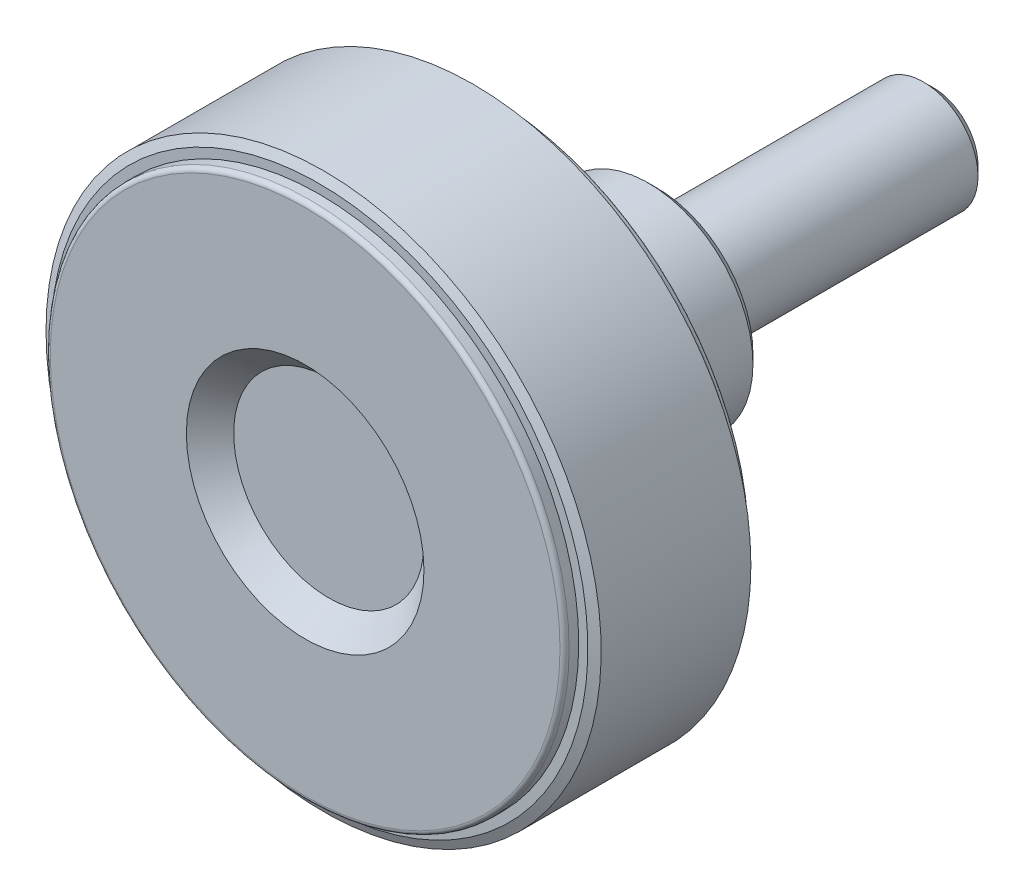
ISO-10303-21;
HEADER;
FILE_DESCRIPTION(('STEP AP214'),'2;1');
FILE_NAME('part.step','',(''),(''),'','','');
FILE_SCHEMA(('AUTOMOTIVE_DESIGN { 1 0 10303 214 1 1 1 1 }'));
ENDSEC;
DATA;
#1=APPLICATION_CONTEXT('core data for automotive mechanical design processes');
#2=APPLICATION_PROTOCOL_DEFINITION('international standard','automotive_design',2000,#1);
#3=PRODUCT_CONTEXT('',#1,'mechanical');
#4=PRODUCT('Part','Part','',(#3));
#5=PRODUCT_RELATED_PRODUCT_CATEGORY('part','',(#4));
#6=PRODUCT_DEFINITION_FORMATION('','',#4);
#7=PRODUCT_DEFINITION_CONTEXT('part definition',#1,'design');
#8=PRODUCT_DEFINITION('design','',#6,#7);
#9=PRODUCT_DEFINITION_SHAPE('','',#8);
#10=(LENGTH_UNIT() NAMED_UNIT(*) SI_UNIT(.MILLI.,.METRE.));
#11=(NAMED_UNIT(*) PLANE_ANGLE_UNIT() SI_UNIT($,.RADIAN.));
#12=(NAMED_UNIT(*) SI_UNIT($,.STERADIAN.) SOLID_ANGLE_UNIT());
#13=UNCERTAINTY_MEASURE_WITH_UNIT(LENGTH_MEASURE(1.E-05),#10,'distance_accuracy_value','');
#14=(GEOMETRIC_REPRESENTATION_CONTEXT(3) GLOBAL_UNCERTAINTY_ASSIGNED_CONTEXT((#13)) GLOBAL_UNIT_ASSIGNED_CONTEXT((#10,
#11,#12)) REPRESENTATION_CONTEXT('',''));
#15=CARTESIAN_POINT('',(0.,0.,0.));
#16=DIRECTION('',(0.,0.,1.));
#17=DIRECTION('',(1.,0.,0.));
#18=AXIS2_PLACEMENT_3D('',#15,#16,#17);
#19=CARTESIAN_POINT('',(0.,2.46325,-30.));
#20=DIRECTION('',(0.,0.,-1.));
#21=DIRECTION('',(-1.,0.,0.));
#22=AXIS2_PLACEMENT_3D('',#19,#20,#21);
#23=PLANE('',#22);
#24=CARTESIAN_POINT('',(0.,0.,-29.9999999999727));
#25=DIRECTION('',(0.,0.,1.));
#26=DIRECTION('',(1.,0.,0.));
#27=AXIS2_PLACEMENT_3D('',#24,#25,#26);
#28=CIRCLE('',#27,4.92650000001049);
#29=CARTESIAN_POINT('',(4.92650000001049,0.,-29.9999999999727));
#30=VERTEX_POINT('',#29);
#31=EDGE_CURVE('E179',#30,#30,#28,.T.);
#32=ORIENTED_EDGE('',*,*,#31,.F.);
#33=EDGE_LOOP('',(#32));
#34=FACE_BOUND('',#33,.T.);
#35=ADVANCED_FACE('F14',(#34),#23,.T.);
#36=CARTESIAN_POINT('',(0.,0.,-28.9265000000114));
#37=DIRECTION('',(0.,0.,1.));
#38=DIRECTION('',(1.,0.,0.));
#39=AXIS2_PLACEMENT_3D('',#36,#37,#38);
#40=CONICAL_SURFACE('',#39,5.99999999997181,0.785398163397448);
#41=ORIENTED_EDGE('',*,*,#31,.T.);
#42=EDGE_LOOP('',(#41));
#43=FACE_BOUND('',#42,.T.);
#44=CARTESIAN_POINT('',(0.,0.,-28.9265));
#45=DIRECTION('',(0.,0.,1.));
#46=DIRECTION('',(1.,0.,0.));
#47=AXIS2_PLACEMENT_3D('',#44,#45,#46);
#48=CIRCLE('',#47,6.);
#49=CARTESIAN_POINT('',(6.,0.,-28.9265));
#50=VERTEX_POINT('',#49);
#51=EDGE_CURVE('E176',#50,#50,#48,.T.);
#52=ORIENTED_EDGE('',*,*,#51,.F.);
#53=EDGE_LOOP('',(#52));
#54=FACE_BOUND('',#53,.T.);
#55=ADVANCED_FACE('F536',(#43,#54),#40,.T.);
#56=CARTESIAN_POINT('',(0.,0.,-13.96325));
#57=DIRECTION('',(0.,0.,1.));
#58=DIRECTION('',(1.,0.,0.));
#59=AXIS2_PLACEMENT_3D('',#56,#57,#58);
#60=CYLINDRICAL_SURFACE('',#59,6.);
#61=ORIENTED_EDGE('',*,*,#51,.T.);
#62=EDGE_LOOP('',(#61));
#63=FACE_BOUND('',#62,.T.);
#64=CARTESIAN_POINT('',(0.,0.,0.));
#65=DIRECTION('',(0.,0.,1.));
#66=DIRECTION('',(1.,0.,0.));
#67=AXIS2_PLACEMENT_3D('',#64,#65,#66);
#68=CIRCLE('',#67,6.);
#69=CARTESIAN_POINT('',(6.,0.,0.));
#70=VERTEX_POINT('',#69);
#71=EDGE_CURVE('E178',#70,#70,#68,.T.);
#72=ORIENTED_EDGE('',*,*,#71,.F.);
#73=EDGE_LOOP('',(#72));
#74=FACE_BOUND('',#73,.T.);
#75=ADVANCED_FACE('F526',(#63,#74),#60,.T.);
#76=CARTESIAN_POINT('',(0.,4.,0.));
#77=DIRECTION('',(0.,0.,-1.));
#78=DIRECTION('',(-1.,0.,0.));
#79=AXIS2_PLACEMENT_3D('',#76,#77,#78);
#80=PLANE('',#79);
#81=CARTESIAN_POINT('',(0.,0.,0.));
#82=DIRECTION('',(0.,0.,1.));
#83=DIRECTION('',(1.,0.,0.));
#84=AXIS2_PLACEMENT_3D('',#81,#82,#83);
#85=CIRCLE('',#84,8.);
#86=CARTESIAN_POINT('',(8.,0.,0.));
#87=VERTEX_POINT('',#86);
#88=EDGE_CURVE('E211',#87,#87,#85,.T.);
#89=ORIENTED_EDGE('',*,*,#88,.F.);
#90=EDGE_LOOP('',(#89));
#91=FACE_BOUND('',#90,.T.);
#92=ORIENTED_EDGE('',*,*,#71,.T.);
#93=EDGE_LOOP('',(#92));
#94=FACE_BOUND('',#93,.T.);
#95=ADVANCED_FACE('F516',(#91,#94),#80,.T.);
#96=CARTESIAN_POINT('',(0.,0.,0.15));
#97=DIRECTION('',(0.,0.,1.));
#98=DIRECTION('',(1.,0.,0.));
#99=AXIS2_PLACEMENT_3D('',#96,#97,#98);
#100=CYLINDRICAL_SURFACE('',#99,8.);
#101=ORIENTED_EDGE('',*,*,#88,.T.);
#102=EDGE_LOOP('',(#101));
#103=FACE_BOUND('',#102,.T.);
#104=CARTESIAN_POINT('',(0.,0.,0.3));
#105=DIRECTION('',(0.,0.,1.));
#106=DIRECTION('',(1.,0.,0.));
#107=AXIS2_PLACEMENT_3D('',#104,#105,#106);
#108=CIRCLE('',#107,8.);
#109=CARTESIAN_POINT('',(8.,0.,0.3));
#110=VERTEX_POINT('',#109);
#111=EDGE_CURVE('E208',#110,#110,#108,.T.);
#112=ORIENTED_EDGE('',*,*,#111,.F.);
#113=EDGE_LOOP('',(#112));
#114=FACE_BOUND('',#113,.T.);
#115=ADVANCED_FACE('F506',(#103,#114),#100,.T.);
#116=CARTESIAN_POINT('',(0.,9.25,0.3));
#117=DIRECTION('',(0.,0.,-1.));
#118=DIRECTION('',(-1.,0.,0.));
#119=AXIS2_PLACEMENT_3D('',#116,#117,#118);
#120=PLANE('',#119);
#121=CARTESIAN_POINT('',(0.,0.,0.3));
#122=DIRECTION('',(0.,0.,1.));
#123=DIRECTION('',(1.,0.,0.));
#124=AXIS2_PLACEMENT_3D('',#121,#122,#123);
#125=CIRCLE('',#124,10.5);
#126=CARTESIAN_POINT('',(10.5,0.,0.3));
#127=VERTEX_POINT('',#126);
#128=EDGE_CURVE('E175',#127,#127,#125,.T.);
#129=ORIENTED_EDGE('',*,*,#128,.F.);
#130=EDGE_LOOP('',(#129));
#131=FACE_BOUND('',#130,.T.);
#132=ORIENTED_EDGE('',*,*,#111,.T.);
#133=EDGE_LOOP('',(#132));
#134=FACE_BOUND('',#133,.T.);
#135=ADVANCED_FACE('F496',(#131,#134),#120,.T.);
#136=CARTESIAN_POINT('',(0.,0.,1.3));
#137=DIRECTION('',(0.,0.,1.));
#138=DIRECTION('',(1.,0.,0.));
#139=AXIS2_PLACEMENT_3D('',#136,#137,#138);
#140=CONICAL_SURFACE('',#139,11.5,0.785398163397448);
#141=ORIENTED_EDGE('',*,*,#128,.T.);
#142=EDGE_LOOP('',(#141));
#143=FACE_BOUND('',#142,.T.);
#144=CARTESIAN_POINT('',(0.,0.,1.3));
#145=DIRECTION('',(0.,0.,1.));
#146=DIRECTION('',(1.,0.,0.));
#147=AXIS2_PLACEMENT_3D('',#144,#145,#146);
#148=CIRCLE('',#147,11.5);
#149=CARTESIAN_POINT('',(11.5,0.,1.3));
#150=VERTEX_POINT('',#149);
#151=EDGE_CURVE('E172',#150,#150,#148,.T.);
#152=ORIENTED_EDGE('',*,*,#151,.F.);
#153=EDGE_LOOP('',(#152));
#154=FACE_BOUND('',#153,.T.);
#155=ADVANCED_FACE('F487',(#143,#154),#140,.T.);
#156=CARTESIAN_POINT('',(0.,0.,16.4));
#157=DIRECTION('',(0.,0.,1.));
#158=DIRECTION('',(1.,0.,0.));
#159=AXIS2_PLACEMENT_3D('',#156,#157,#158);
#160=CYLINDRICAL_SURFACE('',#159,11.5);
#161=ORIENTED_EDGE('',*,*,#151,.T.);
#162=EDGE_LOOP('',(#161));
#163=FACE_BOUND('',#162,.T.);
#164=CARTESIAN_POINT('',(0.,0.,31.5));
#165=DIRECTION('',(0.,0.,-1.));
#166=DIRECTION('',(-1.,0.,0.));
#167=AXIS2_PLACEMENT_3D('',#164,#165,#166);
#168=CIRCLE('',#167,11.5);
#169=CARTESIAN_POINT('',(-11.5,0.,31.5));
#170=VERTEX_POINT('',#169);
#171=EDGE_CURVE('E75',#170,#170,#168,.T.);
#172=ORIENTED_EDGE('',*,*,#171,.T.);
#173=EDGE_LOOP('',(#172));
#174=FACE_BOUND('',#173,.T.);
#175=ADVANCED_FACE('F482',(#163,#174),#160,.T.);
#176=CARTESIAN_POINT('',(0.,0.,31.5));
#177=DIRECTION('',(0.,0.,-1.));
#178=DIRECTION('',(-1.,0.,0.));
#179=AXIS2_PLACEMENT_3D('',#176,#177,#178);
#180=TOROIDAL_SURFACE('',#179,12.5,1.);
#181=CARTESIAN_POINT('',(0.,0.,32.5));
#182=DIRECTION('',(0.,0.,-1.));
#183=DIRECTION('',(1.,0.,0.));
#184=AXIS2_PLACEMENT_3D('',#181,#182,#183);
#185=CIRCLE('',#184,12.5);
#186=CARTESIAN_POINT('',(-12.5,0.,32.5));
#187=VERTEX_POINT('',#186);
#188=CARTESIAN_POINT('',(12.5,0.,32.5));
#189=VERTEX_POINT('',#188);
#190=EDGE_CURVE('E68',#187,#189,#185,.F.);
#191=ORIENTED_EDGE('',*,*,#190,.F.);
#192=CARTESIAN_POINT('',(0.,0.,32.5));
#193=DIRECTION('',(0.,0.,-1.));
#194=DIRECTION('',(-1.,0.,0.));
#195=AXIS2_PLACEMENT_3D('',#192,#193,#194);
#196=CIRCLE('',#195,12.5);
#197=CARTESIAN_POINT('',(0.,12.5,32.5));
#198=VERTEX_POINT('',#197);
#199=EDGE_CURVE('E71',#198,#187,#196,.F.);
#200=ORIENTED_EDGE('',*,*,#199,.F.);
#201=CARTESIAN_POINT('',(0.,0.,32.5));
#202=DIRECTION('',(0.,0.,-1.));
#203=DIRECTION('',(0.,1.,0.));
#204=AXIS2_PLACEMENT_3D('',#201,#202,#203);
#205=CIRCLE('',#204,12.5);
#206=EDGE_CURVE('E63',#189,#198,#205,.F.);
#207=ORIENTED_EDGE('',*,*,#206,.F.);
#208=EDGE_LOOP('',(#191,#200,#207));
#209=FACE_BOUND('',#208,.T.);
#210=ORIENTED_EDGE('',*,*,#171,.F.);
#211=EDGE_LOOP('',(#210));
#212=FACE_BOUND('',#211,.T.);
#213=ADVANCED_FACE('F66',(#209,#212),#180,.F.);
#214=CARTESIAN_POINT('',(0.,17.4807692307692,32.5));
#215=DIRECTION('',(0.,0.,-1.));
#216=DIRECTION('',(-1.,0.,0.));
#217=AXIS2_PLACEMENT_3D('',#214,#215,#216);
#218=PLANE('',#217);
#219=CARTESIAN_POINT('',(0.,0.,32.5));
#220=DIRECTION('',(0.,0.,1.));
#221=DIRECTION('',(-1.,0.,0.));
#222=AXIS2_PLACEMENT_3D('',#219,#220,#221);
#223=CIRCLE('',#222,22.4615384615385);
#224=CARTESIAN_POINT('',(22.4615384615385,0.,32.5));
#225=VERTEX_POINT('',#224);
#226=CARTESIAN_POINT('',(-22.4615384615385,0.,32.5));
#227=VERTEX_POINT('',#226);
#228=EDGE_CURVE('E81',#225,#227,#223,.F.);
#229=ORIENTED_EDGE('',*,*,#228,.T.);
#230=CARTESIAN_POINT('',(0.,0.,32.5));
#231=DIRECTION('',(0.,0.,1.));
#232=DIRECTION('',(0.,1.,0.));
#233=AXIS2_PLACEMENT_3D('',#230,#231,#232);
#234=CIRCLE('',#233,22.4615384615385);
#235=CARTESIAN_POINT('',(0.,22.4615384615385,32.5));
#236=VERTEX_POINT('',#235);
#237=EDGE_CURVE('E130',#227,#236,#234,.F.);
#238=ORIENTED_EDGE('',*,*,#237,.T.);
#239=CARTESIAN_POINT('',(0.,0.,32.5));
#240=DIRECTION('',(0.,0.,1.));
#241=DIRECTION('',(1.,0.,0.));
#242=AXIS2_PLACEMENT_3D('',#239,#240,#241);
#243=CIRCLE('',#242,22.4615384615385);
#244=EDGE_CURVE('E143',#236,#225,#243,.F.);
#245=ORIENTED_EDGE('',*,*,#244,.T.);
#246=EDGE_LOOP('',(#229,#238,#245));
#247=FACE_BOUND('',#246,.T.);
#248=ORIENTED_EDGE('',*,*,#199,.T.);
#249=ORIENTED_EDGE('',*,*,#190,.T.);
#250=ORIENTED_EDGE('',*,*,#206,.T.);
#251=EDGE_LOOP('',(#248,#249,#250));
#252=FACE_BOUND('',#251,.T.);
#253=ADVANCED_FACE('F79',(#247,#252),#218,.T.);
#254=CARTESIAN_POINT('',(0.,0.,31.5));
#255=DIRECTION('',(0.,0.,-1.));
#256=DIRECTION('',(-1.,0.,0.));
#257=AXIS2_PLACEMENT_3D('',#254,#255,#256);
#258=TOROIDAL_SURFACE('',#257,22.4615384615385,1.);
#259=ORIENTED_EDGE('',*,*,#237,.F.);
#260=ORIENTED_EDGE('',*,*,#228,.F.);
#261=ORIENTED_EDGE('',*,*,#244,.F.);
#262=EDGE_LOOP('',(#259,#260,#261));
#263=FACE_BOUND('',#262,.T.);
#264=CARTESIAN_POINT('',(0.,0.,31.5));
#265=DIRECTION('',(0.,0.,1.));
#266=DIRECTION('',(1.,0.,0.));
#267=AXIS2_PLACEMENT_3D('',#264,#265,#266);
#268=CIRCLE('',#267,23.4615384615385);
#269=CARTESIAN_POINT('',(23.4615384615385,0.,31.5));
#270=VERTEX_POINT('',#269);
#271=EDGE_CURVE('E205',#270,#270,#268,.F.);
#272=ORIENTED_EDGE('',*,*,#271,.T.);
#273=EDGE_LOOP('',(#272));
#274=FACE_BOUND('',#273,.T.);
#275=ADVANCED_FACE('F100',(#263,#274),#258,.F.);
#276=CARTESIAN_POINT('',(0.,0.,25.));
#277=DIRECTION('',(0.,0.,1.));
#278=DIRECTION('',(1.,0.,0.));
#279=AXIS2_PLACEMENT_3D('',#276,#277,#278);
#280=CYLINDRICAL_SURFACE('',#279,23.4615384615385);
#281=ORIENTED_EDGE('',*,*,#271,.F.);
#282=EDGE_LOOP('',(#281));
#283=FACE_BOUND('',#282,.T.);
#284=CARTESIAN_POINT('',(0.,0.,18.5));
#285=DIRECTION('',(0.,0.,1.));
#286=DIRECTION('',(1.,0.,0.));
#287=AXIS2_PLACEMENT_3D('',#284,#285,#286);
#288=CIRCLE('',#287,23.4615384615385);
#289=CARTESIAN_POINT('',(23.4615384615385,0.,18.5));
#290=VERTEX_POINT('',#289);
#291=EDGE_CURVE('E201',#290,#290,#288,.T.);
#292=ORIENTED_EDGE('',*,*,#291,.F.);
#293=EDGE_LOOP('',(#292));
#294=FACE_BOUND('',#293,.T.);
#295=ADVANCED_FACE('F329',(#283,#294),#280,.F.);
#296=CARTESIAN_POINT('',(0.,25.7307692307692,18.5));
#297=DIRECTION('',(0.,0.,-1.));
#298=DIRECTION('',(-1.,0.,0.));
#299=AXIS2_PLACEMENT_3D('',#296,#297,#298);
#300=PLANE('',#299);
#301=CARTESIAN_POINT('',(0.,0.,18.5));
#302=DIRECTION('',(0.,0.,1.));
#303=DIRECTION('',(-1.,0.,0.));
#304=AXIS2_PLACEMENT_3D('',#301,#302,#303);
#305=CIRCLE('',#304,28.);
#306=CARTESIAN_POINT('',(-28.,0.,18.5));
#307=VERTEX_POINT('',#306);
#308=CARTESIAN_POINT('',(28.,0.,18.5));
#309=VERTEX_POINT('',#308);
#310=EDGE_CURVE('E264',#307,#309,#305,.T.);
#311=ORIENTED_EDGE('',*,*,#310,.F.);
#312=CARTESIAN_POINT('',(0.,0.,18.5));
#313=DIRECTION('',(0.,0.,1.));
#314=DIRECTION('',(0.,1.,0.));
#315=AXIS2_PLACEMENT_3D('',#312,#313,#314);
#316=CIRCLE('',#315,28.);
#317=CARTESIAN_POINT('',(0.,28.,18.5));
#318=VERTEX_POINT('',#317);
#319=EDGE_CURVE('E299',#318,#307,#316,.T.);
#320=ORIENTED_EDGE('',*,*,#319,.F.);
#321=CARTESIAN_POINT('',(0.,0.,18.5));
#322=DIRECTION('',(0.,0.,1.));
#323=DIRECTION('',(1.,0.,0.));
#324=AXIS2_PLACEMENT_3D('',#321,#322,#323);
#325=CIRCLE('',#324,28.);
#326=EDGE_CURVE('E204',#309,#318,#325,.T.);
#327=ORIENTED_EDGE('',*,*,#326,.F.);
#328=EDGE_LOOP('',(#311,#320,#327));
#329=FACE_BOUND('',#328,.T.);
#330=ORIENTED_EDGE('',*,*,#291,.T.);
#331=EDGE_LOOP('',(#330));
#332=FACE_BOUND('',#331,.T.);
#333=ADVANCED_FACE('F275',(#329,#332),#300,.T.);
#334=CARTESIAN_POINT('',(0.,0.,19.));
#335=DIRECTION('',(0.,0.,-1.));
#336=DIRECTION('',(-1.,0.,0.));
#337=AXIS2_PLACEMENT_3D('',#334,#335,#336);
#338=TOROIDAL_SURFACE('',#337,28.,0.5);
#339=ORIENTED_EDGE('',*,*,#319,.T.);
#340=ORIENTED_EDGE('',*,*,#310,.T.);
#341=ORIENTED_EDGE('',*,*,#326,.T.);
#342=EDGE_LOOP('',(#339,#340,#341));
#343=FACE_BOUND('',#342,.T.);
#344=CARTESIAN_POINT('',(0.,0.,19.));
#345=DIRECTION('',(0.,0.,1.));
#346=DIRECTION('',(1.,0.,0.));
#347=AXIS2_PLACEMENT_3D('',#344,#345,#346);
#348=CIRCLE('',#347,28.5);
#349=CARTESIAN_POINT('',(28.5,0.,19.));
#350=VERTEX_POINT('',#349);
#351=EDGE_CURVE('E200',#350,#350,#348,.T.);
#352=ORIENTED_EDGE('',*,*,#351,.F.);
#353=EDGE_LOOP('',(#352));
#354=FACE_BOUND('',#353,.T.);
#355=ADVANCED_FACE('F269',(#343,#354),#338,.T.);
#356=CARTESIAN_POINT('',(0.,0.,19.53));
#357=DIRECTION('',(0.,0.,1.));
#358=DIRECTION('',(1.,0.,0.));
#359=AXIS2_PLACEMENT_3D('',#356,#357,#358);
#360=CYLINDRICAL_SURFACE('',#359,28.5);
#361=ORIENTED_EDGE('',*,*,#351,.T.);
#362=EDGE_LOOP('',(#361));
#363=FACE_BOUND('',#362,.T.);
#364=CARTESIAN_POINT('',(0.,0.,20.06));
#365=DIRECTION('',(0.,0.,1.));
#366=DIRECTION('',(1.,0.,0.));
#367=AXIS2_PLACEMENT_3D('',#364,#365,#366);
#368=CIRCLE('',#367,28.5);
#369=CARTESIAN_POINT('',(28.5,0.,20.06));
#370=VERTEX_POINT('',#369);
#371=EDGE_CURVE('E197',#370,#370,#368,.T.);
#372=ORIENTED_EDGE('',*,*,#371,.F.);
#373=EDGE_LOOP('',(#372));
#374=FACE_BOUND('',#373,.T.);
#375=ADVANCED_FACE('F274',(#363,#374),#360,.T.);
#376=CARTESIAN_POINT('',(0.,29.,20.06));
#377=DIRECTION('',(0.,0.,-1.));
#378=DIRECTION('',(-1.,0.,0.));
#379=AXIS2_PLACEMENT_3D('',#376,#377,#378);
#380=PLANE('',#379);
#381=CARTESIAN_POINT('',(0.,0.,20.06));
#382=DIRECTION('',(0.,0.,1.));
#383=DIRECTION('',(1.,0.,0.));
#384=AXIS2_PLACEMENT_3D('',#381,#382,#383);
#385=CIRCLE('',#384,29.5);
#386=CARTESIAN_POINT('',(29.5,0.,20.06));
#387=VERTEX_POINT('',#386);
#388=EDGE_CURVE('E193',#387,#387,#385,.T.);
#389=ORIENTED_EDGE('',*,*,#388,.F.);
#390=EDGE_LOOP('',(#389));
#391=FACE_BOUND('',#390,.T.);
#392=ORIENTED_EDGE('',*,*,#371,.T.);
#393=EDGE_LOOP('',(#392));
#394=FACE_BOUND('',#393,.T.);
#395=ADVANCED_FACE('F342',(#391,#394),#380,.T.);
#396=CARTESIAN_POINT('',(0.,0.,20.526307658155));
#397=DIRECTION('',(0.,0.,1.));
#398=DIRECTION('',(1.,0.,0.));
#399=AXIS2_PLACEMENT_3D('',#396,#397,#398);
#400=CONICAL_SURFACE('',#399,30.5,1.13446401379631);
#401=CARTESIAN_POINT('',(-1.81188397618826E-13,-3.78364006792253E-12,20.526307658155));
#402=DIRECTION('',(0.,0.,-1.));
#403=DIRECTION('',(-1.,0.,0.));
#404=AXIS2_PLACEMENT_3D('',#401,#402,#403);
#405=CIRCLE('',#404,30.5000000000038);
#406=CARTESIAN_POINT('',(-30.500000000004,-3.78364006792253E-12,20.526307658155));
#407=VERTEX_POINT('',#406);
#408=EDGE_CURVE('E196',#407,#407,#405,.F.);
#409=ORIENTED_EDGE('',*,*,#408,.F.);
#410=EDGE_LOOP('',(#409));
#411=FACE_BOUND('',#410,.T.);
#412=ORIENTED_EDGE('',*,*,#388,.T.);
#413=EDGE_LOOP('',(#412));
#414=FACE_BOUND('',#413,.T.);
#415=ADVANCED_FACE('F340',(#411,#414),#400,.T.);
#416=CARTESIAN_POINT('',(0.,5.22727272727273,36.4));
#417=DIRECTION('',(0.,0.,1.));
#418=DIRECTION('',(1.,0.,0.));
#419=AXIS2_PLACEMENT_3D('',#416,#417,#418);
#420=PLANE('',#419);
#421=CARTESIAN_POINT('',(0.,0.,36.4));
#422=DIRECTION('',(0.,0.,1.));
#423=DIRECTION('',(1.,0.,0.));
#424=AXIS2_PLACEMENT_3D('',#421,#422,#423);
#425=CIRCLE('',#424,10.4545454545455);
#426=CARTESIAN_POINT('',(10.4545454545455,0.,36.4));
#427=VERTEX_POINT('',#426);
#428=EDGE_CURVE('E181',#427,#427,#425,.T.);
#429=ORIENTED_EDGE('',*,*,#428,.T.);
#430=EDGE_LOOP('',(#429));
#431=FACE_BOUND('',#430,.T.);
#432=ADVANCED_FACE('F242',(#431),#420,.T.);
#433=CARTESIAN_POINT('',(0.,0.,39.));
#434=DIRECTION('',(0.,0.,1.));
#435=DIRECTION('',(1.,0.,0.));
#436=AXIS2_PLACEMENT_3D('',#433,#434,#435);
#437=CONICAL_SURFACE('',#436,13.0545454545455,0.785398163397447);
#438=CARTESIAN_POINT('',(0.,0.,39.));
#439=DIRECTION('',(0.,0.,1.));
#440=DIRECTION('',(1.,0.,0.));
#441=AXIS2_PLACEMENT_3D('',#438,#439,#440);
#442=CIRCLE('',#441,13.0545454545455);
#443=CARTESIAN_POINT('',(13.0545454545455,0.,39.));
#444=VERTEX_POINT('',#443);
#445=EDGE_CURVE('E9',#444,#444,#442,.F.);
#446=ORIENTED_EDGE('',*,*,#445,.F.);
#447=EDGE_LOOP('',(#446));
#448=FACE_BOUND('',#447,.T.);
#449=ORIENTED_EDGE('',*,*,#428,.F.);
#450=EDGE_LOOP('',(#449));
#451=FACE_BOUND('',#450,.T.);
#452=ADVANCED_FACE('F240',(#448,#451),#437,.F.);
#453=CARTESIAN_POINT('',(0.,20.5272727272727,39.));
#454=DIRECTION('',(0.,0.,1.));
#455=DIRECTION('',(1.,0.,0.));
#456=AXIS2_PLACEMENT_3D('',#453,#454,#455);
#457=PLANE('',#456);
#458=ORIENTED_EDGE('',*,*,#445,.T.);
#459=EDGE_LOOP('',(#458));
#460=FACE_BOUND('',#459,.T.);
#461=CARTESIAN_POINT('',(0.,0.,39.));
#462=DIRECTION('',(0.,0.,-1.));
#463=DIRECTION('',(-1.,0.,0.));
#464=AXIS2_PLACEMENT_3D('',#461,#462,#463);
#465=CIRCLE('',#464,28.);
#466=CARTESIAN_POINT('',(0.,28.,39.));
#467=VERTEX_POINT('',#466);
#468=CARTESIAN_POINT('',(-28.,0.,39.));
#469=VERTEX_POINT('',#468);
#470=EDGE_CURVE('E219',#467,#469,#465,.F.);
#471=ORIENTED_EDGE('',*,*,#470,.T.);
#472=CARTESIAN_POINT('',(0.,0.,39.));
#473=DIRECTION('',(0.,0.,-1.));
#474=DIRECTION('',(1.,0.,0.));
#475=AXIS2_PLACEMENT_3D('',#472,#473,#474);
#476=CIRCLE('',#475,28.);
#477=CARTESIAN_POINT('',(28.,0.,39.));
#478=VERTEX_POINT('',#477);
#479=EDGE_CURVE('E23',#469,#478,#476,.F.);
#480=ORIENTED_EDGE('',*,*,#479,.T.);
#481=CARTESIAN_POINT('',(0.,0.,39.));
#482=DIRECTION('',(0.,0.,-1.));
#483=DIRECTION('',(0.,1.,0.));
#484=AXIS2_PLACEMENT_3D('',#481,#482,#483);
#485=CIRCLE('',#484,28.);
#486=EDGE_CURVE('E184',#478,#467,#485,.F.);
#487=ORIENTED_EDGE('',*,*,#486,.T.);
#488=EDGE_LOOP('',(#471,#480,#487));
#489=FACE_BOUND('',#488,.T.);
#490=ADVANCED_FACE('F238',(#460,#489),#457,.T.);
#491=CARTESIAN_POINT('',(0.,0.,38.5));
#492=DIRECTION('',(0.,0.,-1.));
#493=DIRECTION('',(-1.,0.,0.));
#494=AXIS2_PLACEMENT_3D('',#491,#492,#493);
#495=TOROIDAL_SURFACE('',#494,28.,0.5);
#496=CARTESIAN_POINT('',(0.,0.,38.5));
#497=DIRECTION('',(0.,0.,-1.));
#498=DIRECTION('',(-1.,0.,0.));
#499=AXIS2_PLACEMENT_3D('',#496,#497,#498);
#500=CIRCLE('',#499,28.5);
#501=CARTESIAN_POINT('',(-28.5,0.,38.5));
#502=VERTEX_POINT('',#501);
#503=EDGE_CURVE('E185',#502,#502,#500,.F.);
#504=ORIENTED_EDGE('',*,*,#503,.T.);
#505=EDGE_LOOP('',(#504));
#506=FACE_BOUND('',#505,.T.);
#507=ORIENTED_EDGE('',*,*,#479,.F.);
#508=ORIENTED_EDGE('',*,*,#470,.F.);
#509=ORIENTED_EDGE('',*,*,#486,.F.);
#510=EDGE_LOOP('',(#507,#508,#509));
#511=FACE_BOUND('',#510,.T.);
#512=ADVANCED_FACE('F226',(#506,#511),#495,.T.);
#513=CARTESIAN_POINT('',(0.,0.,37.97));
#514=DIRECTION('',(0.,0.,1.));
#515=DIRECTION('',(1.,0.,0.));
#516=AXIS2_PLACEMENT_3D('',#513,#514,#515);
#517=CYLINDRICAL_SURFACE('',#516,28.5);
#518=ORIENTED_EDGE('',*,*,#503,.F.);
#519=EDGE_LOOP('',(#518));
#520=FACE_BOUND('',#519,.T.);
#521=CARTESIAN_POINT('',(0.,0.,37.44));
#522=DIRECTION('',(0.,0.,1.));
#523=DIRECTION('',(1.,0.,0.));
#524=AXIS2_PLACEMENT_3D('',#521,#522,#523);
#525=CIRCLE('',#524,28.5);
#526=CARTESIAN_POINT('',(28.5,0.,37.44));
#527=VERTEX_POINT('',#526);
#528=EDGE_CURVE('E186',#527,#527,#525,.T.);
#529=ORIENTED_EDGE('',*,*,#528,.T.);
#530=EDGE_LOOP('',(#529));
#531=FACE_BOUND('',#530,.T.);
#532=ADVANCED_FACE('F237',(#520,#531),#517,.T.);
#533=CARTESIAN_POINT('',(0.,0.,36.973692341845));
#534=DIRECTION('',(0.,0.,-1.));
#535=DIRECTION('',(-1.,0.,0.));
#536=AXIS2_PLACEMENT_3D('',#533,#534,#535);
#537=CONICAL_SURFACE('',#536,30.5,1.13446401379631);
#538=CARTESIAN_POINT('',(0.,0.,37.44));
#539=DIRECTION('',(0.,0.,-1.));
#540=DIRECTION('',(-1.,0.,0.));
#541=AXIS2_PLACEMENT_3D('',#538,#539,#540);
#542=CIRCLE('',#541,29.5);
#543=CARTESIAN_POINT('',(-29.5,0.,37.44));
#544=VERTEX_POINT('',#543);
#545=EDGE_CURVE('E189',#544,#544,#542,.F.);
#546=ORIENTED_EDGE('',*,*,#545,.F.);
#547=EDGE_LOOP('',(#546));
#548=FACE_BOUND('',#547,.T.);
#549=CARTESIAN_POINT('',(0.,0.,36.973692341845));
#550=DIRECTION('',(0.,0.,-1.));
#551=DIRECTION('',(0.,1.,0.));
#552=AXIS2_PLACEMENT_3D('',#549,#550,#551);
#553=CIRCLE('',#552,30.5);
#554=CARTESIAN_POINT('',(0.,30.5,36.973692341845));
#555=VERTEX_POINT('',#554);
#556=EDGE_CURVE('E192',#555,#555,#553,.F.);
#557=ORIENTED_EDGE('',*,*,#556,.T.);
#558=EDGE_LOOP('',(#557));
#559=FACE_BOUND('',#558,.T.);
#560=ADVANCED_FACE('F360',(#548,#559),#537,.T.);
#561=CARTESIAN_POINT('',(0.,29.,37.44));
#562=DIRECTION('',(0.,0.,1.));
#563=DIRECTION('',(1.,0.,0.));
#564=AXIS2_PLACEMENT_3D('',#561,#562,#563);
#565=PLANE('',#564);
#566=ORIENTED_EDGE('',*,*,#528,.F.);
#567=EDGE_LOOP('',(#566));
#568=FACE_BOUND('',#567,.T.);
#569=ORIENTED_EDGE('',*,*,#545,.T.);
#570=EDGE_LOOP('',(#569));
#571=FACE_BOUND('',#570,.T.);
#572=ADVANCED_FACE('F358',(#568,#571),#565,.T.);
#573=CARTESIAN_POINT('',(-1.81188397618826E-13,-3.78364006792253E-12,0.));
#574=DIRECTION('',(0.,0.,-1.));
#575=DIRECTION('',(-1.,0.,0.));
#576=AXIS2_PLACEMENT_3D('',#573,#574,#575);
#577=CYLINDRICAL_SURFACE('',#576,30.5000000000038);
#578=ORIENTED_EDGE('',*,*,#408,.T.);
#579=EDGE_LOOP('',(#578));
#580=FACE_BOUND('',#579,.T.);
#581=ORIENTED_EDGE('',*,*,#556,.F.);
#582=EDGE_LOOP('',(#581));
#583=FACE_BOUND('',#582,.T.);
#584=ADVANCED_FACE('F355',(#580,#583),#577,.T.);
#585=CLOSED_SHELL('',(#35,#55,#75,#95,#115,#135,#155,#175,#213,#253,#275,#295,#333,#355,#375,
#395,#415,#432,#452,#490,#512,#532,#560,#572,#584));
#586=MANIFOLD_SOLID_BREP('B1',#585);
#587=ADVANCED_BREP_SHAPE_REPRESENTATION('',(#18,#586),#14);
#588=SHAPE_DEFINITION_REPRESENTATION(#9,#587);
ENDSEC;
END-ISO-10303-21;
